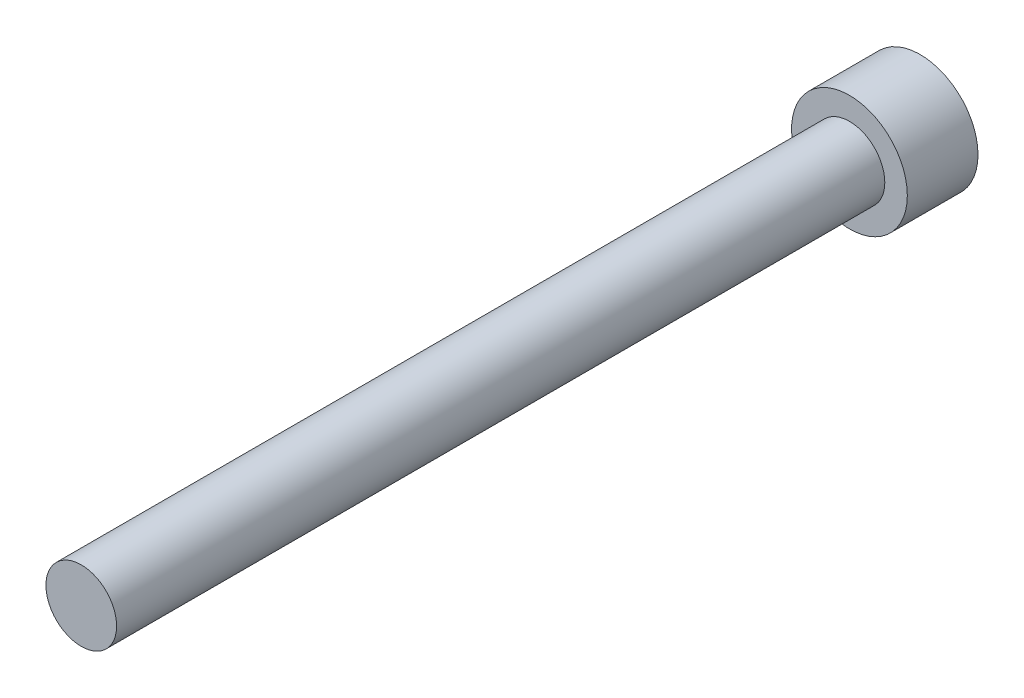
ISO-10303-21;
HEADER;
FILE_DESCRIPTION(('STEP AP214'),'2;1');
FILE_NAME('part.step','',(''),(''),'','','');
FILE_SCHEMA(('AUTOMOTIVE_DESIGN { 1 0 10303 214 1 1 1 1 }'));
ENDSEC;
DATA;
#1=APPLICATION_CONTEXT('core data for automotive mechanical design processes');
#2=APPLICATION_PROTOCOL_DEFINITION('international standard','automotive_design',2000,#1);
#3=PRODUCT_CONTEXT('',#1,'mechanical');
#4=PRODUCT('Part','Part','',(#3));
#5=PRODUCT_RELATED_PRODUCT_CATEGORY('part','',(#4));
#6=PRODUCT_DEFINITION_FORMATION('','',#4);
#7=PRODUCT_DEFINITION_CONTEXT('part definition',#1,'design');
#8=PRODUCT_DEFINITION('design','',#6,#7);
#9=PRODUCT_DEFINITION_SHAPE('','',#8);
#10=(LENGTH_UNIT() NAMED_UNIT(*) SI_UNIT(.MILLI.,.METRE.));
#11=(NAMED_UNIT(*) PLANE_ANGLE_UNIT() SI_UNIT($,.RADIAN.));
#12=(NAMED_UNIT(*) SI_UNIT($,.STERADIAN.) SOLID_ANGLE_UNIT());
#13=UNCERTAINTY_MEASURE_WITH_UNIT(LENGTH_MEASURE(1.E-05),#10,'distance_accuracy_value','');
#14=(GEOMETRIC_REPRESENTATION_CONTEXT(3) GLOBAL_UNCERTAINTY_ASSIGNED_CONTEXT((#13)) GLOBAL_UNIT_ASSIGNED_CONTEXT((#10,
#11,#12)) REPRESENTATION_CONTEXT('',''));
#15=CARTESIAN_POINT('',(0.,0.,0.));
#16=DIRECTION('',(0.,0.,1.));
#17=DIRECTION('',(1.,0.,0.));
#18=AXIS2_PLACEMENT_3D('',#15,#16,#17);
#19=CARTESIAN_POINT('',(0.,-2.8702,-3.5052));
#20=DIRECTION('',(0.,0.,-1.));
#21=DIRECTION('',(-1.,0.,0.));
#22=AXIS2_PLACEMENT_3D('',#19,#20,#21);
#23=PLANE('',#22);
#24=DIRECTION('',(0.866025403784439,-0.5,0.));
#25=VECTOR('',#24,1.);
#26=CARTESIAN_POINT('',(0.,1.5984519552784,-3.5052));
#27=LINE('',#26,#25);
#28=CARTESIAN_POINT('',(0.,1.5984519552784,-3.5052));
#29=VERTEX_POINT('',#28);
#30=CARTESIAN_POINT('',(1.3843,0.799225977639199,-3.5052));
#31=VERTEX_POINT('',#30);
#32=EDGE_CURVE('E51',#29,#31,#27,.T.);
#33=ORIENTED_EDGE('',*,*,#32,.F.);
#34=DIRECTION('',(0.866025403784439,0.5,0.));
#35=VECTOR('',#34,1.);
#36=CARTESIAN_POINT('',(-1.3843,0.7992259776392,-3.5052));
#37=LINE('',#36,#35);
#38=CARTESIAN_POINT('',(-1.3843,0.7992259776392,-3.5052));
#39=VERTEX_POINT('',#38);
#40=EDGE_CURVE('E134',#39,#29,#37,.T.);
#41=ORIENTED_EDGE('',*,*,#40,.F.);
#42=DIRECTION('',(0.,1.,0.));
#43=VECTOR('',#42,1.);
#44=CARTESIAN_POINT('',(-1.3843,-0.799225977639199,-3.5052));
#45=LINE('',#44,#43);
#46=CARTESIAN_POINT('',(-1.3843,-0.799225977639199,-3.5052));
#47=VERTEX_POINT('',#46);
#48=EDGE_CURVE('E132',#47,#39,#45,.T.);
#49=ORIENTED_EDGE('',*,*,#48,.F.);
#50=DIRECTION('',(-0.866025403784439,0.5,0.));
#51=VECTOR('',#50,1.);
#52=CARTESIAN_POINT('',(0.,-1.5984519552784,-3.5052));
#53=LINE('',#52,#51);
#54=CARTESIAN_POINT('',(0.,-1.5984519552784,-3.5052));
#55=VERTEX_POINT('',#54);
#56=EDGE_CURVE('E99',#55,#47,#53,.T.);
#57=ORIENTED_EDGE('',*,*,#56,.F.);
#58=DIRECTION('',(-0.866025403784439,-0.5,0.));
#59=VECTOR('',#58,1.);
#60=CARTESIAN_POINT('',(1.3843,-0.799225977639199,-3.5052));
#61=LINE('',#60,#59);
#62=CARTESIAN_POINT('',(1.3843,-0.799225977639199,-3.5052));
#63=VERTEX_POINT('',#62);
#64=EDGE_CURVE('E128',#63,#55,#61,.T.);
#65=ORIENTED_EDGE('',*,*,#64,.F.);
#66=DIRECTION('',(0.,-1.,0.));
#67=VECTOR('',#66,1.);
#68=CARTESIAN_POINT('',(1.3843,0.799225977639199,-3.5052));
#69=LINE('',#68,#67);
#70=EDGE_CURVE('E125',#31,#63,#69,.T.);
#71=ORIENTED_EDGE('',*,*,#70,.F.);
#72=EDGE_LOOP('',(#33,#41,#49,#57,#65,#71));
#73=FACE_BOUND('',#72,.T.);
#74=CARTESIAN_POINT('',(0.,0.,-3.5052));
#75=DIRECTION('',(0.,0.,1.));
#76=DIRECTION('',(1.,0.,0.));
#77=AXIS2_PLACEMENT_3D('',#74,#75,#76);
#78=CIRCLE('',#77,2.8702);
#79=CARTESIAN_POINT('',(2.8702,0.,-3.5052));
#80=VERTEX_POINT('',#79);
#81=EDGE_CURVE('E11',#80,#80,#78,.T.);
#82=ORIENTED_EDGE('',*,*,#81,.F.);
#83=EDGE_LOOP('',(#82));
#84=FACE_BOUND('',#83,.T.);
#85=ADVANCED_FACE('F37',(#73,#84),#23,.T.);
#86=CARTESIAN_POINT('',(0.,0.,38.1));
#87=DIRECTION('',(0.,0.,1.));
#88=DIRECTION('',(1.,0.,0.));
#89=AXIS2_PLACEMENT_3D('',#86,#87,#88);
#90=CYLINDRICAL_SURFACE('',#89,2.8702);
#91=ORIENTED_EDGE('',*,*,#81,.T.);
#92=EDGE_LOOP('',(#91));
#93=FACE_BOUND('',#92,.T.);
#94=CARTESIAN_POINT('',(0.,0.,0.));
#95=DIRECTION('',(0.,0.,1.));
#96=DIRECTION('',(1.,0.,0.));
#97=AXIS2_PLACEMENT_3D('',#94,#95,#96);
#98=CIRCLE('',#97,2.8702);
#99=CARTESIAN_POINT('',(2.8702,0.,0.));
#100=VERTEX_POINT('',#99);
#101=EDGE_CURVE('E44',#100,#100,#98,.T.);
#102=ORIENTED_EDGE('',*,*,#101,.F.);
#103=EDGE_LOOP('',(#102));
#104=FACE_BOUND('',#103,.T.);
#105=ADVANCED_FACE('F154',(#93,#104),#90,.T.);
#106=CARTESIAN_POINT('',(0.,-1.7526,0.));
#107=DIRECTION('',(0.,0.,1.));
#108=DIRECTION('',(1.,0.,0.));
#109=AXIS2_PLACEMENT_3D('',#106,#107,#108);
#110=PLANE('',#109);
#111=ORIENTED_EDGE('',*,*,#101,.T.);
#112=EDGE_LOOP('',(#111));
#113=FACE_BOUND('',#112,.T.);
#114=CARTESIAN_POINT('',(0.,0.,0.));
#115=DIRECTION('',(0.,0.,1.));
#116=DIRECTION('',(1.,0.,0.));
#117=AXIS2_PLACEMENT_3D('',#114,#115,#116);
#118=CIRCLE('',#117,1.7526);
#119=CARTESIAN_POINT('',(1.7526,0.,0.));
#120=VERTEX_POINT('',#119);
#121=EDGE_CURVE('E146',#120,#120,#118,.T.);
#122=ORIENTED_EDGE('',*,*,#121,.F.);
#123=EDGE_LOOP('',(#122));
#124=FACE_BOUND('',#123,.T.);
#125=ADVANCED_FACE('F151',(#113,#124),#110,.T.);
#126=CARTESIAN_POINT('',(0.,0.,38.1));
#127=DIRECTION('',(0.,0.,1.));
#128=DIRECTION('',(1.,0.,0.));
#129=AXIS2_PLACEMENT_3D('',#126,#127,#128);
#130=CYLINDRICAL_SURFACE('',#129,1.7526);
#131=ORIENTED_EDGE('',*,*,#121,.T.);
#132=EDGE_LOOP('',(#131));
#133=FACE_BOUND('',#132,.T.);
#134=CARTESIAN_POINT('',(0.,0.,38.1));
#135=DIRECTION('',(0.,0.,1.));
#136=DIRECTION('',(1.,0.,0.));
#137=AXIS2_PLACEMENT_3D('',#134,#135,#136);
#138=CIRCLE('',#137,1.7526);
#139=CARTESIAN_POINT('',(1.7526,0.,38.1));
#140=VERTEX_POINT('',#139);
#141=EDGE_CURVE('E138',#140,#140,#138,.T.);
#142=ORIENTED_EDGE('',*,*,#141,.F.);
#143=EDGE_LOOP('',(#142));
#144=FACE_BOUND('',#143,.T.);
#145=ADVANCED_FACE('F161',(#133,#144),#130,.T.);
#146=CARTESIAN_POINT('',(0.,0.,38.1));
#147=DIRECTION('',(0.,0.,1.));
#148=DIRECTION('',(1.,0.,0.));
#149=AXIS2_PLACEMENT_3D('',#146,#147,#148);
#150=PLANE('',#149);
#151=ORIENTED_EDGE('',*,*,#141,.T.);
#152=EDGE_LOOP('',(#151));
#153=FACE_BOUND('',#152,.T.);
#154=ADVANCED_FACE('F167',(#153),#150,.T.);
#155=CARTESIAN_POINT('',(0.,1.5984519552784,-1.4732));
#156=DIRECTION('',(0.5,0.866025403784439,0.));
#157=DIRECTION('',(-0.866025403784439,0.5,0.));
#158=AXIS2_PLACEMENT_3D('',#155,#156,#157);
#159=PLANE('',#158);
#160=ORIENTED_EDGE('',*,*,#32,.T.);
#161=DIRECTION('',(0.,0.,-1.));
#162=VECTOR('',#161,1.);
#163=CARTESIAN_POINT('',(1.3843,0.799225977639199,-1.4732));
#164=LINE('',#163,#162);
#165=CARTESIAN_POINT('',(1.3843,0.799225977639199,-1.4732));
#166=VERTEX_POINT('',#165);
#167=EDGE_CURVE('E81',#166,#31,#164,.T.);
#168=ORIENTED_EDGE('',*,*,#167,.F.);
#169=DIRECTION('',(0.866025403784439,-0.5,0.));
#170=VECTOR('',#169,1.);
#171=CARTESIAN_POINT('',(0.,1.5984519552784,-1.4732));
#172=LINE('',#171,#170);
#173=CARTESIAN_POINT('',(0.,1.5984519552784,-1.4732));
#174=VERTEX_POINT('',#173);
#175=EDGE_CURVE('E136',#174,#166,#172,.T.);
#176=ORIENTED_EDGE('',*,*,#175,.F.);
#177=DIRECTION('',(0.,0.,-1.));
#178=VECTOR('',#177,1.);
#179=CARTESIAN_POINT('',(0.,1.5984519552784,-1.4732));
#180=LINE('',#179,#178);
#181=EDGE_CURVE('E59',#174,#29,#180,.T.);
#182=ORIENTED_EDGE('',*,*,#181,.T.);
#183=EDGE_LOOP('',(#160,#168,#176,#182));
#184=FACE_BOUND('',#183,.T.);
#185=ADVANCED_FACE('F171',(#184),#159,.F.);
#186=CARTESIAN_POINT('',(-1.3843,0.7992259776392,-1.4732));
#187=DIRECTION('',(-0.5,0.866025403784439,0.));
#188=DIRECTION('',(-0.866025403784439,-0.5,0.));
#189=AXIS2_PLACEMENT_3D('',#186,#187,#188);
#190=PLANE('',#189);
#191=ORIENTED_EDGE('',*,*,#40,.T.);
#192=ORIENTED_EDGE('',*,*,#181,.F.);
#193=DIRECTION('',(0.866025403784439,0.5,0.));
#194=VECTOR('',#193,1.);
#195=CARTESIAN_POINT('',(-1.3843,0.7992259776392,-1.4732));
#196=LINE('',#195,#194);
#197=CARTESIAN_POINT('',(-1.3843,0.7992259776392,-1.4732));
#198=VERTEX_POINT('',#197);
#199=EDGE_CURVE('E111',#198,#174,#196,.T.);
#200=ORIENTED_EDGE('',*,*,#199,.F.);
#201=DIRECTION('',(0.,0.,-1.));
#202=VECTOR('',#201,1.);
#203=CARTESIAN_POINT('',(-1.3843,0.7992259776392,-1.4732));
#204=LINE('',#203,#202);
#205=EDGE_CURVE('E103',#198,#39,#204,.T.);
#206=ORIENTED_EDGE('',*,*,#205,.T.);
#207=EDGE_LOOP('',(#191,#192,#200,#206));
#208=FACE_BOUND('',#207,.T.);
#209=ADVANCED_FACE('F175',(#208),#190,.F.);
#210=CARTESIAN_POINT('',(-1.3843,-0.799225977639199,-1.4732));
#211=DIRECTION('',(-1.,0.,0.));
#212=DIRECTION('',(0.,0.,1.));
#213=AXIS2_PLACEMENT_3D('',#210,#211,#212);
#214=PLANE('',#213);
#215=ORIENTED_EDGE('',*,*,#48,.T.);
#216=ORIENTED_EDGE('',*,*,#205,.F.);
#217=DIRECTION('',(0.,1.,0.));
#218=VECTOR('',#217,1.);
#219=CARTESIAN_POINT('',(-1.3843,-0.799225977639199,-1.4732));
#220=LINE('',#219,#218);
#221=CARTESIAN_POINT('',(-1.3843,-0.799225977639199,-1.4732));
#222=VERTEX_POINT('',#221);
#223=EDGE_CURVE('E107',#222,#198,#220,.T.);
#224=ORIENTED_EDGE('',*,*,#223,.F.);
#225=DIRECTION('',(0.,0.,-1.));
#226=VECTOR('',#225,1.);
#227=CARTESIAN_POINT('',(-1.3843,-0.799225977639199,-1.4732));
#228=LINE('',#227,#226);
#229=EDGE_CURVE('E92',#222,#47,#228,.T.);
#230=ORIENTED_EDGE('',*,*,#229,.T.);
#231=EDGE_LOOP('',(#215,#216,#224,#230));
#232=FACE_BOUND('',#231,.T.);
#233=ADVANCED_FACE('F108',(#232),#214,.F.);
#234=CARTESIAN_POINT('',(0.,-1.5984519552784,-1.4732));
#235=DIRECTION('',(-0.5,-0.866025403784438,0.));
#236=DIRECTION('',(0.866025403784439,-0.5,0.));
#237=AXIS2_PLACEMENT_3D('',#234,#235,#236);
#238=PLANE('',#237);
#239=ORIENTED_EDGE('',*,*,#56,.T.);
#240=ORIENTED_EDGE('',*,*,#229,.F.);
#241=DIRECTION('',(-0.866025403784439,0.5,0.));
#242=VECTOR('',#241,1.);
#243=CARTESIAN_POINT('',(0.,-1.5984519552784,-1.4732));
#244=LINE('',#243,#242);
#245=CARTESIAN_POINT('',(0.,-1.5984519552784,-1.4732));
#246=VERTEX_POINT('',#245);
#247=EDGE_CURVE('E96',#246,#222,#244,.T.);
#248=ORIENTED_EDGE('',*,*,#247,.F.);
#249=DIRECTION('',(0.,0.,-1.));
#250=VECTOR('',#249,1.);
#251=CARTESIAN_POINT('',(0.,-1.5984519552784,-1.4732));
#252=LINE('',#251,#250);
#253=EDGE_CURVE('E104',#246,#55,#252,.T.);
#254=ORIENTED_EDGE('',*,*,#253,.T.);
#255=EDGE_LOOP('',(#239,#240,#248,#254));
#256=FACE_BOUND('',#255,.T.);
#257=ADVANCED_FACE('F94',(#256),#238,.F.);
#258=CARTESIAN_POINT('',(1.3843,-0.799225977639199,-1.4732));
#259=DIRECTION('',(0.5,-0.866025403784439,0.));
#260=DIRECTION('',(0.866025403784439,0.5,0.));
#261=AXIS2_PLACEMENT_3D('',#258,#259,#260);
#262=PLANE('',#261);
#263=ORIENTED_EDGE('',*,*,#64,.T.);
#264=ORIENTED_EDGE('',*,*,#253,.F.);
#265=DIRECTION('',(-0.866025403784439,-0.5,0.));
#266=VECTOR('',#265,1.);
#267=CARTESIAN_POINT('',(1.3843,-0.799225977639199,-1.4732));
#268=LINE('',#267,#266);
#269=CARTESIAN_POINT('',(1.3843,-0.799225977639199,-1.4732));
#270=VERTEX_POINT('',#269);
#271=EDGE_CURVE('E117',#270,#246,#268,.T.);
#272=ORIENTED_EDGE('',*,*,#271,.F.);
#273=DIRECTION('',(0.,0.,-1.));
#274=VECTOR('',#273,1.);
#275=CARTESIAN_POINT('',(1.3843,-0.799225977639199,-1.4732));
#276=LINE('',#275,#274);
#277=EDGE_CURVE('E141',#270,#63,#276,.T.);
#278=ORIENTED_EDGE('',*,*,#277,.T.);
#279=EDGE_LOOP('',(#263,#264,#272,#278));
#280=FACE_BOUND('',#279,.T.);
#281=ADVANCED_FACE('F179',(#280),#262,.F.);
#282=CARTESIAN_POINT('',(1.3843,0.799225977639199,-1.4732));
#283=DIRECTION('',(1.,0.,0.));
#284=DIRECTION('',(0.,1.,0.));
#285=AXIS2_PLACEMENT_3D('',#282,#283,#284);
#286=PLANE('',#285);
#287=ORIENTED_EDGE('',*,*,#70,.T.);
#288=ORIENTED_EDGE('',*,*,#277,.F.);
#289=DIRECTION('',(0.,-1.,0.));
#290=VECTOR('',#289,1.);
#291=CARTESIAN_POINT('',(1.3843,0.799225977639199,-1.4732));
#292=LINE('',#291,#290);
#293=EDGE_CURVE('E119',#166,#270,#292,.T.);
#294=ORIENTED_EDGE('',*,*,#293,.F.);
#295=ORIENTED_EDGE('',*,*,#167,.T.);
#296=EDGE_LOOP('',(#287,#288,#294,#295));
#297=FACE_BOUND('',#296,.T.);
#298=ADVANCED_FACE('F176',(#297),#286,.F.);
#299=CARTESIAN_POINT('',(1.3843,0.799225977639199,-1.4732));
#300=DIRECTION('',(0.,0.,-1.));
#301=DIRECTION('',(-1.,0.,0.));
#302=AXIS2_PLACEMENT_3D('',#299,#300,#301);
#303=PLANE('',#302);
#304=ORIENTED_EDGE('',*,*,#175,.T.);
#305=ORIENTED_EDGE('',*,*,#293,.T.);
#306=ORIENTED_EDGE('',*,*,#271,.T.);
#307=ORIENTED_EDGE('',*,*,#247,.T.);
#308=ORIENTED_EDGE('',*,*,#223,.T.);
#309=ORIENTED_EDGE('',*,*,#199,.T.);
#310=EDGE_LOOP('',(#304,#305,#306,#307,#308,#309));
#311=FACE_BOUND('',#310,.T.);
#312=ADVANCED_FACE('F114',(#311),#303,.T.);
#313=CLOSED_SHELL('',(#85,#105,#125,#145,#154,#185,#209,#233,#257,#281,#298,#312));
#314=MANIFOLD_SOLID_BREP('B2',#313);
#315=ADVANCED_BREP_SHAPE_REPRESENTATION('',(#18,#314),#14);
#316=SHAPE_DEFINITION_REPRESENTATION(#9,#315);
ENDSEC;
END-ISO-10303-21;
